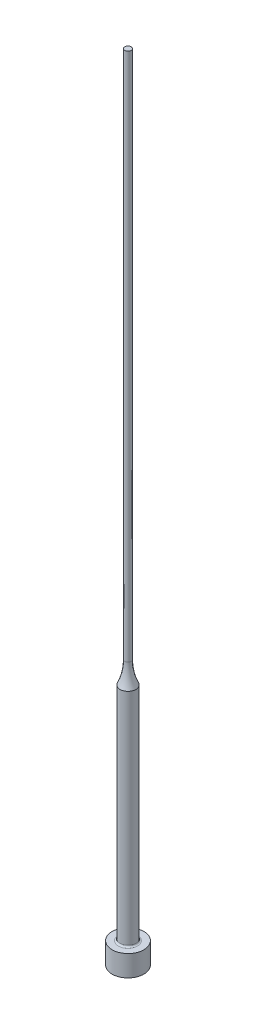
ISO-10303-21;
HEADER;
FILE_DESCRIPTION(('STEP AP214'),'2;1');
FILE_NAME('part.step','',(''),(''),'','','');
FILE_SCHEMA(('AUTOMOTIVE_DESIGN { 1 0 10303 214 1 1 1 1 }'));
ENDSEC;
DATA;
#1=APPLICATION_CONTEXT('core data for automotive mechanical design processes');
#2=APPLICATION_PROTOCOL_DEFINITION('international standard','automotive_design',2000,#1);
#3=PRODUCT_CONTEXT('',#1,'mechanical');
#4=PRODUCT('Part','Part','',(#3));
#5=PRODUCT_RELATED_PRODUCT_CATEGORY('part','',(#4));
#6=PRODUCT_DEFINITION_FORMATION('','',#4);
#7=PRODUCT_DEFINITION_CONTEXT('part definition',#1,'design');
#8=PRODUCT_DEFINITION('design','',#6,#7);
#9=PRODUCT_DEFINITION_SHAPE('','',#8);
#10=(LENGTH_UNIT() NAMED_UNIT(*) SI_UNIT(.MILLI.,.METRE.));
#11=(NAMED_UNIT(*) PLANE_ANGLE_UNIT() SI_UNIT($,.RADIAN.));
#12=(NAMED_UNIT(*) SI_UNIT($,.STERADIAN.) SOLID_ANGLE_UNIT());
#13=UNCERTAINTY_MEASURE_WITH_UNIT(LENGTH_MEASURE(1.E-05),#10,'distance_accuracy_value','');
#14=(GEOMETRIC_REPRESENTATION_CONTEXT(3) GLOBAL_UNCERTAINTY_ASSIGNED_CONTEXT((#13)) GLOBAL_UNIT_ASSIGNED_CONTEXT((#10,
#11,#12)) REPRESENTATION_CONTEXT('',''));
#15=CARTESIAN_POINT('',(0.,0.,0.));
#16=DIRECTION('',(0.,0.,1.));
#17=DIRECTION('',(1.,0.,0.));
#18=AXIS2_PLACEMENT_3D('',#15,#16,#17);
#19=CARTESIAN_POINT('',(0.600000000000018,150.,0.));
#20=DIRECTION('',(0.,-1.,0.));
#21=DIRECTION('',(1.,0.,0.));
#22=AXIS2_PLACEMENT_3D('',#19,#20,#21);
#23=PLANE('',#22);
#24=CARTESIAN_POINT('',(0.,150.,0.));
#25=DIRECTION('',(0.,1.,0.));
#26=DIRECTION('',(-1.,0.,0.));
#27=AXIS2_PLACEMENT_3D('',#24,#25,#26);
#28=CIRCLE('',#27,0.600000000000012);
#29=CARTESIAN_POINT('',(-0.600000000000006,150.,0.));
#30=VERTEX_POINT('',#29);
#31=EDGE_CURVE('E10',#30,#30,#28,.T.);
#32=ORIENTED_EDGE('',*,*,#31,.T.);
#33=EDGE_LOOP('',(#32));
#34=FACE_BOUND('',#33,.T.);
#35=ADVANCED_FACE('F30',(#34),#23,.F.);
#36=CARTESIAN_POINT('',(0.,150.,0.));
#37=DIRECTION('',(0.,1.,0.));
#38=DIRECTION('',(-1.,0.,0.));
#39=AXIS2_PLACEMENT_3D('',#36,#37,#38);
#40=CYLINDRICAL_SURFACE('',#39,0.600000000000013);
#41=ORIENTED_EDGE('',*,*,#31,.F.);
#42=EDGE_LOOP('',(#41));
#43=FACE_BOUND('',#42,.T.);
#44=CARTESIAN_POINT('',(0.,50.,0.));
#45=DIRECTION('',(0.,1.,0.));
#46=DIRECTION('',(-1.,0.,0.));
#47=AXIS2_PLACEMENT_3D('',#44,#45,#46);
#48=CIRCLE('',#47,0.600000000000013);
#49=CARTESIAN_POINT('',(-0.600000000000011,50.,0.));
#50=VERTEX_POINT('',#49);
#51=EDGE_CURVE('E36',#50,#50,#48,.T.);
#52=ORIENTED_EDGE('',*,*,#51,.T.);
#53=EDGE_LOOP('',(#52));
#54=FACE_BOUND('',#53,.T.);
#55=ADVANCED_FACE('F71',(#43,#54),#40,.T.);
#56=CARTESIAN_POINT('',(0.,50.,0.));
#57=DIRECTION('',(0.,1.,0.));
#58=DIRECTION('',(-1.,0.,0.));
#59=AXIS2_PLACEMENT_3D('',#56,#57,#58);
#60=TOROIDAL_SURFACE('',#59,10.6,10.);
#61=ORIENTED_EDGE('',*,*,#51,.F.);
#62=EDGE_LOOP('',(#61));
#63=FACE_BOUND('',#62,.T.);
#64=CARTESIAN_POINT('',(0.,45.8539175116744,0.));
#65=DIRECTION('',(0.,1.,0.));
#66=DIRECTION('',(-1.,0.,0.));
#67=AXIS2_PLACEMENT_3D('',#64,#65,#66);
#68=CIRCLE('',#67,1.50000000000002);
#69=CARTESIAN_POINT('',(-1.50000000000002,45.8539175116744,0.));
#70=VERTEX_POINT('',#69);
#71=EDGE_CURVE('E40',#70,#70,#68,.T.);
#72=ORIENTED_EDGE('',*,*,#71,.T.);
#73=EDGE_LOOP('',(#72));
#74=FACE_BOUND('',#73,.T.);
#75=ADVANCED_FACE('F75',(#63,#74),#60,.F.);
#76=CARTESIAN_POINT('',(0.,150.,0.));
#77=DIRECTION('',(0.,1.,0.));
#78=DIRECTION('',(-1.,0.,0.));
#79=AXIS2_PLACEMENT_3D('',#76,#77,#78);
#80=CYLINDRICAL_SURFACE('',#79,1.50000000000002);
#81=ORIENTED_EDGE('',*,*,#71,.F.);
#82=EDGE_LOOP('',(#81));
#83=FACE_BOUND('',#82,.T.);
#84=CARTESIAN_POINT('',(0.,4.3,0.));
#85=DIRECTION('',(0.,1.,0.));
#86=DIRECTION('',(-1.,0.,0.));
#87=AXIS2_PLACEMENT_3D('',#84,#85,#86);
#88=CIRCLE('',#87,1.50000000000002);
#89=CARTESIAN_POINT('',(-1.50000000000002,4.3,0.));
#90=VERTEX_POINT('',#89);
#91=EDGE_CURVE('E44',#90,#90,#88,.T.);
#92=ORIENTED_EDGE('',*,*,#91,.T.);
#93=EDGE_LOOP('',(#92));
#94=FACE_BOUND('',#93,.T.);
#95=ADVANCED_FACE('F80',(#83,#94),#80,.T.);
#96=CARTESIAN_POINT('',(0.,4.3,0.));
#97=DIRECTION('',(0.,1.,0.));
#98=DIRECTION('',(-1.,0.,0.));
#99=AXIS2_PLACEMENT_3D('',#96,#97,#98);
#100=TOROIDAL_SURFACE('',#99,1.80000000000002,0.3);
#101=ORIENTED_EDGE('',*,*,#91,.F.);
#102=EDGE_LOOP('',(#101));
#103=FACE_BOUND('',#102,.T.);
#104=CARTESIAN_POINT('',(0.,4.,0.));
#105=DIRECTION('',(0.,1.,0.));
#106=DIRECTION('',(-1.,0.,0.));
#107=AXIS2_PLACEMENT_3D('',#104,#105,#106);
#108=CIRCLE('',#107,1.80000000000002);
#109=CARTESIAN_POINT('',(-1.80000000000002,4.,0.));
#110=VERTEX_POINT('',#109);
#111=EDGE_CURVE('E49',#110,#110,#108,.T.);
#112=ORIENTED_EDGE('',*,*,#111,.T.);
#113=EDGE_LOOP('',(#112));
#114=FACE_BOUND('',#113,.T.);
#115=ADVANCED_FACE('F86',(#103,#114),#100,.F.);
#116=CARTESIAN_POINT('',(3.00000000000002,4.,0.));
#117=DIRECTION('',(0.,-1.,0.));
#118=DIRECTION('',(1.,0.,0.));
#119=AXIS2_PLACEMENT_3D('',#116,#117,#118);
#120=PLANE('',#119);
#121=ORIENTED_EDGE('',*,*,#111,.F.);
#122=EDGE_LOOP('',(#121));
#123=FACE_BOUND('',#122,.T.);
#124=CARTESIAN_POINT('',(0.,4.,0.));
#125=DIRECTION('',(0.,1.,0.));
#126=DIRECTION('',(-1.,0.,0.));
#127=AXIS2_PLACEMENT_3D('',#124,#125,#126);
#128=CIRCLE('',#127,3.00000000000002);
#129=CARTESIAN_POINT('',(-3.00000000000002,4.,0.));
#130=VERTEX_POINT('',#129);
#131=EDGE_CURVE('E52',#130,#130,#128,.T.);
#132=ORIENTED_EDGE('',*,*,#131,.T.);
#133=EDGE_LOOP('',(#132));
#134=FACE_BOUND('',#133,.T.);
#135=ADVANCED_FACE('F67',(#123,#134),#120,.F.);
#136=CARTESIAN_POINT('',(0.,150.,0.));
#137=DIRECTION('',(0.,1.,0.));
#138=DIRECTION('',(-1.,0.,0.));
#139=AXIS2_PLACEMENT_3D('',#136,#137,#138);
#140=CYLINDRICAL_SURFACE('',#139,3.00000000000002);
#141=ORIENTED_EDGE('',*,*,#131,.F.);
#142=EDGE_LOOP('',(#141));
#143=FACE_BOUND('',#142,.T.);
#144=CARTESIAN_POINT('',(0.,0.,0.));
#145=DIRECTION('',(0.,1.,0.));
#146=DIRECTION('',(-1.,0.,0.));
#147=AXIS2_PLACEMENT_3D('',#144,#145,#146);
#148=CIRCLE('',#147,3.00000000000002);
#149=CARTESIAN_POINT('',(-3.00000000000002,0.,0.));
#150=VERTEX_POINT('',#149);
#151=EDGE_CURVE('E55',#150,#150,#148,.T.);
#152=ORIENTED_EDGE('',*,*,#151,.T.);
#153=EDGE_LOOP('',(#152));
#154=FACE_BOUND('',#153,.T.);
#155=ADVANCED_FACE('F59',(#143,#154),#140,.T.);
#156=CARTESIAN_POINT('',(0.,0.,0.));
#157=DIRECTION('',(0.,1.,0.));
#158=DIRECTION('',(-1.,0.,0.));
#159=AXIS2_PLACEMENT_3D('',#156,#157,#158);
#160=PLANE('',#159);
#161=ORIENTED_EDGE('',*,*,#151,.F.);
#162=EDGE_LOOP('',(#161));
#163=FACE_BOUND('',#162,.T.);
#164=ADVANCED_FACE('F61',(#163),#160,.F.);
#165=CLOSED_SHELL('',(#35,#55,#75,#95,#115,#135,#155,#164));
#166=MANIFOLD_SOLID_BREP('B2',#165);
#167=ADVANCED_BREP_SHAPE_REPRESENTATION('',(#18,#166),#14);
#168=SHAPE_DEFINITION_REPRESENTATION(#9,#167);
ENDSEC;
END-ISO-10303-21;
